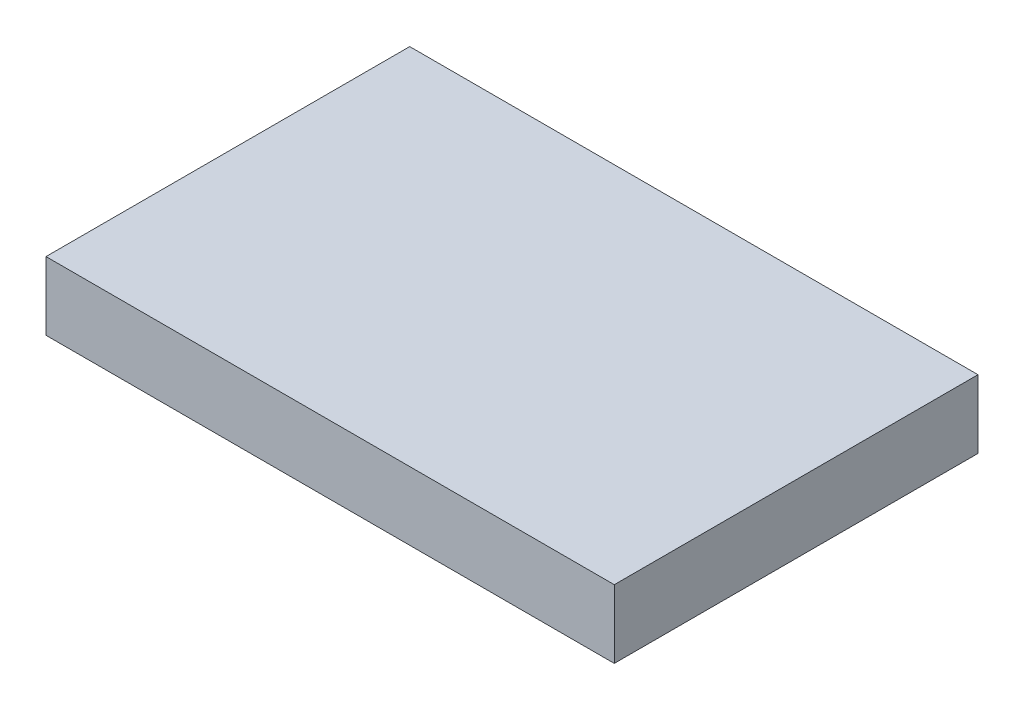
from build123d import *

# Parameters (mm, degrees)
SKETCH_1_W      = 25
SKETCH_1_H      = 16
EXTRUDE_1_DEPTH = 3


with BuildPart() as part:
    # Sketch 1 → Extrude 1 (new body)
    with BuildSketch(Plane(origin=(0, 0, 0), x_dir=(1, 0, 0), z_dir=(0, 1, 0))):
        Rectangle(SKETCH_1_W, SKETCH_1_H)
    extrude(amount=EXTRUDE_1_DEPTH)


solid = part.part
